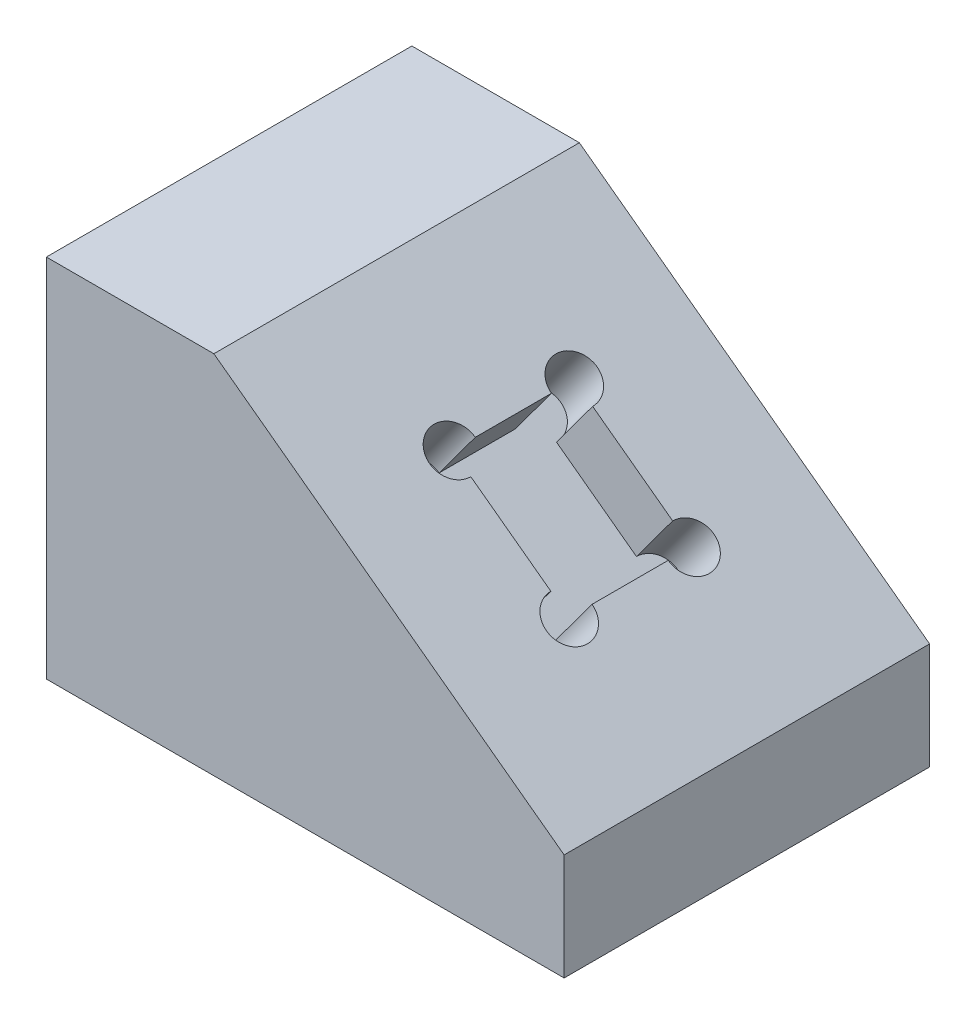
ISO-10303-21;
HEADER;
FILE_DESCRIPTION(('STEP AP214'),'2;1');
FILE_NAME('part.step','',(''),(''),'','','');
FILE_SCHEMA(('AUTOMOTIVE_DESIGN { 1 0 10303 214 1 1 1 1 }'));
ENDSEC;
DATA;
#1=APPLICATION_CONTEXT('core data for automotive mechanical design processes');
#2=APPLICATION_PROTOCOL_DEFINITION('international standard','automotive_design',2000,#1);
#3=PRODUCT_CONTEXT('',#1,'mechanical');
#4=PRODUCT('Part','Part','',(#3));
#5=PRODUCT_RELATED_PRODUCT_CATEGORY('part','',(#4));
#6=PRODUCT_DEFINITION_FORMATION('','',#4);
#7=PRODUCT_DEFINITION_CONTEXT('part definition',#1,'design');
#8=PRODUCT_DEFINITION('design','',#6,#7);
#9=PRODUCT_DEFINITION_SHAPE('','',#8);
#10=(LENGTH_UNIT() NAMED_UNIT(*) SI_UNIT(.MILLI.,.METRE.));
#11=(NAMED_UNIT(*) PLANE_ANGLE_UNIT() SI_UNIT($,.RADIAN.));
#12=(NAMED_UNIT(*) SI_UNIT($,.STERADIAN.) SOLID_ANGLE_UNIT());
#13=UNCERTAINTY_MEASURE_WITH_UNIT(LENGTH_MEASURE(1.E-05),#10,'distance_accuracy_value','');
#14=(GEOMETRIC_REPRESENTATION_CONTEXT(3) GLOBAL_UNCERTAINTY_ASSIGNED_CONTEXT((#13)) GLOBAL_UNIT_ASSIGNED_CONTEXT((#10,
#11,#12)) REPRESENTATION_CONTEXT('',''));
#15=CARTESIAN_POINT('',(0.,0.,0.));
#16=DIRECTION('',(0.,0.,1.));
#17=DIRECTION('',(1.,0.,0.));
#18=AXIS2_PLACEMENT_3D('',#15,#16,#17);
#19=CARTESIAN_POINT('',(0.,0.,-76.2));
#20=DIRECTION('',(-1.,0.,0.));
#21=DIRECTION('',(0.,0.,1.));
#22=AXIS2_PLACEMENT_3D('',#19,#20,#21);
#23=PLANE('',#22);
#24=DIRECTION('',(0.,-1.,0.));
#25=VECTOR('',#24,1.);
#26=CARTESIAN_POINT('',(0.,0.,0.));
#27=LINE('',#26,#25);
#28=CARTESIAN_POINT('',(0.,76.2,0.));
#29=VERTEX_POINT('',#28);
#30=CARTESIAN_POINT('',(0.,0.,0.));
#31=VERTEX_POINT('',#30);
#32=EDGE_CURVE('E122',#29,#31,#27,.T.);
#33=ORIENTED_EDGE('',*,*,#32,.F.);
#34=DIRECTION('',(0.,0.,1.));
#35=VECTOR('',#34,1.);
#36=CARTESIAN_POINT('',(0.,76.2,-76.2));
#37=LINE('',#36,#35);
#38=CARTESIAN_POINT('',(0.,76.2,-76.2));
#39=VERTEX_POINT('',#38);
#40=EDGE_CURVE('E11',#39,#29,#37,.T.);
#41=ORIENTED_EDGE('',*,*,#40,.F.);
#42=DIRECTION('',(0.,-1.,0.));
#43=VECTOR('',#42,1.);
#44=CARTESIAN_POINT('',(0.,0.,-76.2));
#45=LINE('',#44,#43);
#46=CARTESIAN_POINT('',(0.,0.,-76.2));
#47=VERTEX_POINT('',#46);
#48=EDGE_CURVE('E117',#39,#47,#45,.T.);
#49=ORIENTED_EDGE('',*,*,#48,.T.);
#50=DIRECTION('',(0.,0.,1.));
#51=VECTOR('',#50,1.);
#52=CARTESIAN_POINT('',(0.,0.,-76.2));
#53=LINE('',#52,#51);
#54=EDGE_CURVE('E35',#47,#31,#53,.T.);
#55=ORIENTED_EDGE('',*,*,#54,.T.);
#56=EDGE_LOOP('',(#33,#41,#49,#55));
#57=FACE_BOUND('',#56,.T.);
#58=ADVANCED_FACE('F32',(#57),#23,.T.);
#59=CARTESIAN_POINT('',(0.,76.2,-76.2));
#60=DIRECTION('',(0.,1.,0.));
#61=DIRECTION('',(0.,0.,1.));
#62=AXIS2_PLACEMENT_3D('',#59,#60,#61);
#63=PLANE('',#62);
#64=DIRECTION('',(-1.,0.,0.));
#65=VECTOR('',#64,1.);
#66=CARTESIAN_POINT('',(0.,76.2,0.));
#67=LINE('',#66,#65);
#68=CARTESIAN_POINT('',(34.925,76.2,0.));
#69=VERTEX_POINT('',#68);
#70=EDGE_CURVE('E132',#69,#29,#67,.T.);
#71=ORIENTED_EDGE('',*,*,#70,.F.);
#72=DIRECTION('',(0.,0.,1.));
#73=VECTOR('',#72,1.);
#74=CARTESIAN_POINT('',(34.925,76.2,-76.2));
#75=LINE('',#74,#73);
#76=CARTESIAN_POINT('',(34.925,76.2,-76.2));
#77=VERTEX_POINT('',#76);
#78=EDGE_CURVE('E40',#77,#69,#75,.T.);
#79=ORIENTED_EDGE('',*,*,#78,.F.);
#80=DIRECTION('',(-1.,0.,0.));
#81=VECTOR('',#80,1.);
#82=CARTESIAN_POINT('',(0.,76.2,-76.2));
#83=LINE('',#82,#81);
#84=EDGE_CURVE('E112',#77,#39,#83,.T.);
#85=ORIENTED_EDGE('',*,*,#84,.T.);
#86=ORIENTED_EDGE('',*,*,#40,.T.);
#87=EDGE_LOOP('',(#71,#79,#85,#86));
#88=FACE_BOUND('',#87,.T.);
#89=ADVANCED_FACE('F138',(#88),#63,.T.);
#90=CARTESIAN_POINT('',(34.925,76.2,-76.2));
#91=DIRECTION('',(0.594391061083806,0.804176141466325,0.));
#92=DIRECTION('',(-0.804176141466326,0.594391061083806,0.));
#93=AXIS2_PLACEMENT_3D('',#90,#91,#92);
#94=PLANE('',#93);
#95=CARTESIAN_POINT('',(59.2666666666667,58.2083333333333,-25.4));
#96=DIRECTION('',(0.594391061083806,0.804176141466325,0.));
#97=DIRECTION('',(-0.804176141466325,0.594391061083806,0.));
#98=AXIS2_PLACEMENT_3D('',#95,#96,#97);
#99=CIRCLE('',#98,4.7625);
#100=CARTESIAN_POINT('',(59.2666666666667,58.2083333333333,-30.1625));
#101=VERTEX_POINT('',#100);
#102=CARTESIAN_POINT('',(63.0965555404,55.3775459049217,-25.4));
#103=VERTEX_POINT('',#102);
#104=EDGE_CURVE('E48',#101,#103,#99,.T.);
#105=ORIENTED_EDGE('',*,*,#104,.F.);
#106=DIRECTION('',(0.,0.,1.));
#107=VECTOR('',#106,1.);
#108=CARTESIAN_POINT('',(59.2666666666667,58.2083333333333,-46.0375));
#109=LINE('',#108,#107);
#110=CARTESIAN_POINT('',(59.2666666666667,58.2083333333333,-46.0375));
#111=VERTEX_POINT('',#110);
#112=EDGE_CURVE('E209',#111,#101,#109,.T.);
#113=ORIENTED_EDGE('',*,*,#112,.F.);
#114=CARTESIAN_POINT('',(59.2666666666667,58.2083333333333,-50.8));
#115=DIRECTION('',(0.594391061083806,0.804176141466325,0.));
#116=DIRECTION('',(-0.804176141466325,0.594391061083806,0.));
#117=AXIS2_PLACEMENT_3D('',#114,#115,#116);
#118=CIRCLE('',#117,4.7625);
#119=CARTESIAN_POINT('',(63.0965555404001,55.3775459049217,-50.8));
#120=VERTEX_POINT('',#119);
#121=EDGE_CURVE('E214',#120,#111,#118,.T.);
#122=ORIENTED_EDGE('',*,*,#121,.F.);
#123=DIRECTION('',(-0.804176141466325,0.594391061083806,0.));
#124=VECTOR('',#123,1.);
#125=CARTESIAN_POINT('',(79.7784444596,43.0474540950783,-50.8));
#126=LINE('',#125,#124);
#127=CARTESIAN_POINT('',(79.7784444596,43.0474540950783,-50.8));
#128=VERTEX_POINT('',#127);
#129=EDGE_CURVE('E244',#128,#120,#126,.T.);
#130=ORIENTED_EDGE('',*,*,#129,.F.);
#131=CARTESIAN_POINT('',(83.6083333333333,40.2166666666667,-50.8));
#132=DIRECTION('',(0.594391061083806,0.804176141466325,0.));
#133=DIRECTION('',(-0.804176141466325,0.594391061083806,0.));
#134=AXIS2_PLACEMENT_3D('',#131,#132,#133);
#135=CIRCLE('',#134,4.7625);
#136=CARTESIAN_POINT('',(83.6083333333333,40.2166666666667,-46.0375));
#137=VERTEX_POINT('',#136);
#138=EDGE_CURVE('E241',#137,#128,#135,.T.);
#139=ORIENTED_EDGE('',*,*,#138,.F.);
#140=DIRECTION('',(0.,0.,-1.));
#141=VECTOR('',#140,1.);
#142=CARTESIAN_POINT('',(83.6083333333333,40.2166666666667,-46.0375));
#143=LINE('',#142,#141);
#144=CARTESIAN_POINT('',(83.6083333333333,40.2166666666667,-30.1625));
#145=VERTEX_POINT('',#144);
#146=EDGE_CURVE('E238',#145,#137,#143,.T.);
#147=ORIENTED_EDGE('',*,*,#146,.F.);
#148=CARTESIAN_POINT('',(83.6083333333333,40.2166666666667,-25.4));
#149=DIRECTION('',(0.594391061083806,0.804176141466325,0.));
#150=DIRECTION('',(-0.804176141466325,0.594391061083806,0.));
#151=AXIS2_PLACEMENT_3D('',#148,#149,#150);
#152=CIRCLE('',#151,4.7625);
#153=CARTESIAN_POINT('',(79.7784444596,43.0474540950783,-25.4));
#154=VERTEX_POINT('',#153);
#155=EDGE_CURVE('E235',#154,#145,#152,.T.);
#156=ORIENTED_EDGE('',*,*,#155,.F.);
#157=DIRECTION('',(0.804176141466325,-0.594391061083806,0.));
#158=VECTOR('',#157,1.);
#159=CARTESIAN_POINT('',(79.7784444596,43.0474540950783,-25.4));
#160=LINE('',#159,#158);
#161=EDGE_CURVE('E232',#103,#154,#160,.T.);
#162=ORIENTED_EDGE('',*,*,#161,.F.);
#163=EDGE_LOOP('',(#105,#113,#122,#130,#139,#147,#156,#162));
#164=FACE_BOUND('',#163,.T.);
#165=DIRECTION('',(-0.804176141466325,0.594391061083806,0.));
#166=VECTOR('',#165,1.);
#167=CARTESIAN_POINT('',(34.925,76.2,0.));
#168=LINE('',#167,#166);
#169=CARTESIAN_POINT('',(107.95,22.225,0.));
#170=VERTEX_POINT('',#169);
#171=EDGE_CURVE('E101',#170,#69,#168,.T.);
#172=ORIENTED_EDGE('',*,*,#171,.F.);
#173=DIRECTION('',(0.,0.,1.));
#174=VECTOR('',#173,1.);
#175=CARTESIAN_POINT('',(107.95,22.225,-76.2));
#176=LINE('',#175,#174);
#177=CARTESIAN_POINT('',(107.95,22.225,-76.2));
#178=VERTEX_POINT('',#177);
#179=EDGE_CURVE('E95',#178,#170,#176,.T.);
#180=ORIENTED_EDGE('',*,*,#179,.F.);
#181=DIRECTION('',(-0.804176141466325,0.594391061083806,0.));
#182=VECTOR('',#181,1.);
#183=CARTESIAN_POINT('',(34.925,76.2,-76.2));
#184=LINE('',#183,#182);
#185=EDGE_CURVE('E98',#178,#77,#184,.T.);
#186=ORIENTED_EDGE('',*,*,#185,.T.);
#187=ORIENTED_EDGE('',*,*,#78,.T.);
#188=EDGE_LOOP('',(#172,#180,#186,#187));
#189=FACE_BOUND('',#188,.T.);
#190=ADVANCED_FACE('F97',(#164,#189),#94,.T.);
#191=CARTESIAN_POINT('',(107.95,0.,-76.2));
#192=DIRECTION('',(1.,0.,0.));
#193=DIRECTION('',(0.,0.,-1.));
#194=AXIS2_PLACEMENT_3D('',#191,#192,#193);
#195=PLANE('',#194);
#196=DIRECTION('',(0.,1.,0.));
#197=VECTOR('',#196,1.);
#198=CARTESIAN_POINT('',(107.95,0.,0.));
#199=LINE('',#198,#197);
#200=CARTESIAN_POINT('',(107.95,0.,0.));
#201=VERTEX_POINT('',#200);
#202=EDGE_CURVE('E129',#201,#170,#199,.T.);
#203=ORIENTED_EDGE('',*,*,#202,.F.);
#204=DIRECTION('',(0.,0.,1.));
#205=VECTOR('',#204,1.);
#206=CARTESIAN_POINT('',(107.95,0.,-76.2));
#207=LINE('',#206,#205);
#208=CARTESIAN_POINT('',(107.95,0.,-76.2));
#209=VERTEX_POINT('',#208);
#210=EDGE_CURVE('E106',#209,#201,#207,.T.);
#211=ORIENTED_EDGE('',*,*,#210,.F.);
#212=DIRECTION('',(0.,1.,0.));
#213=VECTOR('',#212,1.);
#214=CARTESIAN_POINT('',(107.95,0.,-76.2));
#215=LINE('',#214,#213);
#216=EDGE_CURVE('E111',#209,#178,#215,.T.);
#217=ORIENTED_EDGE('',*,*,#216,.T.);
#218=ORIENTED_EDGE('',*,*,#179,.T.);
#219=EDGE_LOOP('',(#203,#211,#217,#218));
#220=FACE_BOUND('',#219,.T.);
#221=ADVANCED_FACE('F114',(#220),#195,.T.);
#222=CARTESIAN_POINT('',(0.,0.,-76.2));
#223=DIRECTION('',(0.,-1.,0.));
#224=DIRECTION('',(0.,0.,-1.));
#225=AXIS2_PLACEMENT_3D('',#222,#223,#224);
#226=PLANE('',#225);
#227=DIRECTION('',(1.,0.,0.));
#228=VECTOR('',#227,1.);
#229=CARTESIAN_POINT('',(0.,0.,0.));
#230=LINE('',#229,#228);
#231=EDGE_CURVE('E125',#31,#201,#230,.T.);
#232=ORIENTED_EDGE('',*,*,#231,.F.);
#233=ORIENTED_EDGE('',*,*,#54,.F.);
#234=DIRECTION('',(1.,0.,0.));
#235=VECTOR('',#234,1.);
#236=CARTESIAN_POINT('',(0.,0.,-76.2));
#237=LINE('',#236,#235);
#238=EDGE_CURVE('E115',#47,#209,#237,.T.);
#239=ORIENTED_EDGE('',*,*,#238,.T.);
#240=ORIENTED_EDGE('',*,*,#210,.T.);
#241=EDGE_LOOP('',(#232,#233,#239,#240));
#242=FACE_BOUND('',#241,.T.);
#243=ADVANCED_FACE('F135',(#242),#226,.T.);
#244=CARTESIAN_POINT('',(0.,76.2,-76.2));
#245=DIRECTION('',(0.,0.,-1.));
#246=DIRECTION('',(-1.,0.,0.));
#247=AXIS2_PLACEMENT_3D('',#244,#245,#246);
#248=PLANE('',#247);
#249=ORIENTED_EDGE('',*,*,#48,.F.);
#250=ORIENTED_EDGE('',*,*,#84,.F.);
#251=ORIENTED_EDGE('',*,*,#185,.F.);
#252=ORIENTED_EDGE('',*,*,#216,.F.);
#253=ORIENTED_EDGE('',*,*,#238,.F.);
#254=EDGE_LOOP('',(#249,#250,#251,#252,#253));
#255=FACE_BOUND('',#254,.T.);
#256=ADVANCED_FACE('F110',(#255),#248,.T.);
#257=CARTESIAN_POINT('',(0.,76.2,0.));
#258=DIRECTION('',(0.,0.,-1.));
#259=DIRECTION('',(-1.,0.,0.));
#260=AXIS2_PLACEMENT_3D('',#257,#258,#259);
#261=PLANE('',#260);
#262=ORIENTED_EDGE('',*,*,#32,.T.);
#263=ORIENTED_EDGE('',*,*,#231,.T.);
#264=ORIENTED_EDGE('',*,*,#202,.T.);
#265=ORIENTED_EDGE('',*,*,#171,.T.);
#266=ORIENTED_EDGE('',*,*,#70,.T.);
#267=EDGE_LOOP('',(#262,#263,#264,#265,#266));
#268=FACE_BOUND('',#267,.T.);
#269=ADVANCED_FACE('F137',(#268),#261,.F.);
#270=CARTESIAN_POINT('',(51.7179001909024,47.995296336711,-25.4));
#271=DIRECTION('',(0.594391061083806,0.804176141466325,0.));
#272=DIRECTION('',(-0.804176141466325,0.594391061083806,0.));
#273=AXIS2_PLACEMENT_3D('',#270,#271,#272);
#274=CYLINDRICAL_SURFACE('',#273,4.7625);
#275=ORIENTED_EDGE('',*,*,#104,.T.);
#276=DIRECTION('',(0.594391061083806,0.804176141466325,0.));
#277=VECTOR('',#276,1.);
#278=CARTESIAN_POINT('',(55.5477890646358,45.1645089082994,-25.4));
#279=LINE('',#278,#277);
#280=CARTESIAN_POINT('',(55.5477890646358,45.1645089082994,-25.4));
#281=VERTEX_POINT('',#280);
#282=EDGE_CURVE('E230',#281,#103,#279,.T.);
#283=ORIENTED_EDGE('',*,*,#282,.F.);
#284=CARTESIAN_POINT('',(51.7179001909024,47.995296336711,-25.4));
#285=DIRECTION('',(0.594391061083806,0.804176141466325,0.));
#286=DIRECTION('',(-0.804176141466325,0.594391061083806,0.));
#287=AXIS2_PLACEMENT_3D('',#284,#285,#286);
#288=CIRCLE('',#287,4.7625);
#289=CARTESIAN_POINT('',(51.7179001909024,47.995296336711,-30.1625));
#290=VERTEX_POINT('',#289);
#291=EDGE_CURVE('E200',#290,#281,#288,.T.);
#292=ORIENTED_EDGE('',*,*,#291,.F.);
#293=DIRECTION('',(0.594391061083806,0.804176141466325,0.));
#294=VECTOR('',#293,1.);
#295=CARTESIAN_POINT('',(51.7179001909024,47.995296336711,-30.1625));
#296=LINE('',#295,#294);
#297=EDGE_CURVE('E126',#290,#101,#296,.T.);
#298=ORIENTED_EDGE('',*,*,#297,.T.);
#299=EDGE_LOOP('',(#275,#283,#292,#298));
#300=FACE_BOUND('',#299,.T.);
#301=ADVANCED_FACE('F158',(#300),#274,.F.);
#302=CARTESIAN_POINT('',(51.7179001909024,47.995296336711,-46.0375));
#303=DIRECTION('',(-0.804176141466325,0.594391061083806,0.));
#304=DIRECTION('',(-0.594391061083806,-0.804176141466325,0.));
#305=AXIS2_PLACEMENT_3D('',#302,#303,#304);
#306=PLANE('',#305);
#307=ORIENTED_EDGE('',*,*,#112,.T.);
#308=ORIENTED_EDGE('',*,*,#297,.F.);
#309=DIRECTION('',(0.,0.,1.));
#310=VECTOR('',#309,1.);
#311=CARTESIAN_POINT('',(51.7179001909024,47.995296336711,-46.0375));
#312=LINE('',#311,#310);
#313=CARTESIAN_POINT('',(51.7179001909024,47.995296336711,-46.0375));
#314=VERTEX_POINT('',#313);
#315=EDGE_CURVE('E207',#314,#290,#312,.T.);
#316=ORIENTED_EDGE('',*,*,#315,.F.);
#317=DIRECTION('',(0.594391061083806,0.804176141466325,0.));
#318=VECTOR('',#317,1.);
#319=CARTESIAN_POINT('',(51.7179001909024,47.995296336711,-46.0375));
#320=LINE('',#319,#318);
#321=EDGE_CURVE('E250',#314,#111,#320,.T.);
#322=ORIENTED_EDGE('',*,*,#321,.T.);
#323=EDGE_LOOP('',(#307,#308,#316,#322));
#324=FACE_BOUND('',#323,.T.);
#325=ADVANCED_FACE('F162',(#324),#306,.F.);
#326=CARTESIAN_POINT('',(51.7179001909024,47.995296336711,-50.8));
#327=DIRECTION('',(0.594391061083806,0.804176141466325,0.));
#328=DIRECTION('',(-0.804176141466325,0.594391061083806,0.));
#329=AXIS2_PLACEMENT_3D('',#326,#327,#328);
#330=CYLINDRICAL_SURFACE('',#329,4.7625);
#331=ORIENTED_EDGE('',*,*,#121,.T.);
#332=ORIENTED_EDGE('',*,*,#321,.F.);
#333=CARTESIAN_POINT('',(51.7179001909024,47.995296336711,-50.8));
#334=DIRECTION('',(0.594391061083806,0.804176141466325,0.));
#335=DIRECTION('',(-0.804176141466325,0.594391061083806,0.));
#336=AXIS2_PLACEMENT_3D('',#333,#334,#335);
#337=CIRCLE('',#336,4.7625);
#338=CARTESIAN_POINT('',(55.5477890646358,45.1645089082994,-50.8));
#339=VERTEX_POINT('',#338);
#340=EDGE_CURVE('E227',#339,#314,#337,.T.);
#341=ORIENTED_EDGE('',*,*,#340,.F.);
#342=DIRECTION('',(0.594391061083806,0.804176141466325,0.));
#343=VECTOR('',#342,1.);
#344=CARTESIAN_POINT('',(55.5477890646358,45.1645089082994,-50.8));
#345=LINE('',#344,#343);
#346=EDGE_CURVE('E253',#339,#120,#345,.T.);
#347=ORIENTED_EDGE('',*,*,#346,.T.);
#348=EDGE_LOOP('',(#331,#332,#341,#347));
#349=FACE_BOUND('',#348,.T.);
#350=ADVANCED_FACE('F183',(#349),#330,.F.);
#351=CARTESIAN_POINT('',(72.2296779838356,32.834417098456,-50.8));
#352=DIRECTION('',(0.,0.,-1.));
#353=DIRECTION('',(-1.,0.,0.));
#354=AXIS2_PLACEMENT_3D('',#351,#352,#353);
#355=PLANE('',#354);
#356=ORIENTED_EDGE('',*,*,#129,.T.);
#357=ORIENTED_EDGE('',*,*,#346,.F.);
#358=DIRECTION('',(-0.804176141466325,0.594391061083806,0.));
#359=VECTOR('',#358,1.);
#360=CARTESIAN_POINT('',(72.2296779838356,32.834417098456,-50.8));
#361=LINE('',#360,#359);
#362=CARTESIAN_POINT('',(72.2296779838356,32.834417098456,-50.8));
#363=VERTEX_POINT('',#362);
#364=EDGE_CURVE('E224',#363,#339,#361,.T.);
#365=ORIENTED_EDGE('',*,*,#364,.F.);
#366=DIRECTION('',(0.594391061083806,0.804176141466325,0.));
#367=VECTOR('',#366,1.);
#368=CARTESIAN_POINT('',(72.2296779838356,32.834417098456,-50.8));
#369=LINE('',#368,#367);
#370=EDGE_CURVE('E256',#363,#128,#369,.T.);
#371=ORIENTED_EDGE('',*,*,#370,.T.);
#372=EDGE_LOOP('',(#356,#357,#365,#371));
#373=FACE_BOUND('',#372,.T.);
#374=ADVANCED_FACE('F179',(#373),#355,.F.);
#375=CARTESIAN_POINT('',(76.059566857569,30.0036296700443,-50.8));
#376=DIRECTION('',(0.594391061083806,0.804176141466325,0.));
#377=DIRECTION('',(-0.804176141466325,0.594391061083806,0.));
#378=AXIS2_PLACEMENT_3D('',#375,#376,#377);
#379=CYLINDRICAL_SURFACE('',#378,4.7625);
#380=ORIENTED_EDGE('',*,*,#138,.T.);
#381=ORIENTED_EDGE('',*,*,#370,.F.);
#382=CARTESIAN_POINT('',(76.059566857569,30.0036296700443,-50.8));
#383=DIRECTION('',(0.594391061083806,0.804176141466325,0.));
#384=DIRECTION('',(-0.804176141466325,0.594391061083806,0.));
#385=AXIS2_PLACEMENT_3D('',#382,#383,#384);
#386=CIRCLE('',#385,4.7625);
#387=CARTESIAN_POINT('',(76.059566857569,30.0036296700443,-46.0375));
#388=VERTEX_POINT('',#387);
#389=EDGE_CURVE('E221',#388,#363,#386,.T.);
#390=ORIENTED_EDGE('',*,*,#389,.F.);
#391=DIRECTION('',(0.594391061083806,0.804176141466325,0.));
#392=VECTOR('',#391,1.);
#393=CARTESIAN_POINT('',(76.059566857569,30.0036296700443,-46.0375));
#394=LINE('',#393,#392);
#395=EDGE_CURVE('E259',#388,#137,#394,.T.);
#396=ORIENTED_EDGE('',*,*,#395,.T.);
#397=EDGE_LOOP('',(#380,#381,#390,#396));
#398=FACE_BOUND('',#397,.T.);
#399=ADVANCED_FACE('F175',(#398),#379,.F.);
#400=CARTESIAN_POINT('',(76.059566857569,30.0036296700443,-46.0375));
#401=DIRECTION('',(0.804176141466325,-0.594391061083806,0.));
#402=DIRECTION('',(0.594391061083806,0.804176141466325,0.));
#403=AXIS2_PLACEMENT_3D('',#400,#401,#402);
#404=PLANE('',#403);
#405=ORIENTED_EDGE('',*,*,#146,.T.);
#406=ORIENTED_EDGE('',*,*,#395,.F.);
#407=DIRECTION('',(0.,0.,-1.));
#408=VECTOR('',#407,1.);
#409=CARTESIAN_POINT('',(76.059566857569,30.0036296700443,-46.0375));
#410=LINE('',#409,#408);
#411=CARTESIAN_POINT('',(76.059566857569,30.0036296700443,-30.1625));
#412=VERTEX_POINT('',#411);
#413=EDGE_CURVE('E218',#412,#388,#410,.T.);
#414=ORIENTED_EDGE('',*,*,#413,.F.);
#415=DIRECTION('',(0.594391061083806,0.804176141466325,0.));
#416=VECTOR('',#415,1.);
#417=CARTESIAN_POINT('',(76.059566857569,30.0036296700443,-30.1625));
#418=LINE('',#417,#416);
#419=EDGE_CURVE('E262',#412,#145,#418,.T.);
#420=ORIENTED_EDGE('',*,*,#419,.T.);
#421=EDGE_LOOP('',(#405,#406,#414,#420));
#422=FACE_BOUND('',#421,.T.);
#423=ADVANCED_FACE('F171',(#422),#404,.F.);
#424=CARTESIAN_POINT('',(76.059566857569,30.0036296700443,-25.4));
#425=DIRECTION('',(0.594391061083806,0.804176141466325,0.));
#426=DIRECTION('',(-0.804176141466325,0.594391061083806,0.));
#427=AXIS2_PLACEMENT_3D('',#424,#425,#426);
#428=CYLINDRICAL_SURFACE('',#427,4.7625);
#429=ORIENTED_EDGE('',*,*,#155,.T.);
#430=ORIENTED_EDGE('',*,*,#419,.F.);
#431=CARTESIAN_POINT('',(76.059566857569,30.0036296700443,-25.4));
#432=DIRECTION('',(0.594391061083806,0.804176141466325,0.));
#433=DIRECTION('',(-0.804176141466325,0.594391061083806,0.));
#434=AXIS2_PLACEMENT_3D('',#431,#432,#433);
#435=CIRCLE('',#434,4.7625);
#436=CARTESIAN_POINT('',(72.2296779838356,32.834417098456,-25.4));
#437=VERTEX_POINT('',#436);
#438=EDGE_CURVE('E211',#437,#412,#435,.T.);
#439=ORIENTED_EDGE('',*,*,#438,.F.);
#440=DIRECTION('',(0.594391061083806,0.804176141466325,0.));
#441=VECTOR('',#440,1.);
#442=CARTESIAN_POINT('',(72.2296779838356,32.834417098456,-25.4));
#443=LINE('',#442,#441);
#444=EDGE_CURVE('E265',#437,#154,#443,.T.);
#445=ORIENTED_EDGE('',*,*,#444,.T.);
#446=EDGE_LOOP('',(#429,#430,#439,#445));
#447=FACE_BOUND('',#446,.T.);
#448=ADVANCED_FACE('F167',(#447),#428,.F.);
#449=CARTESIAN_POINT('',(72.2296779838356,32.834417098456,-25.4));
#450=DIRECTION('',(0.,0.,1.));
#451=DIRECTION('',(1.,0.,0.));
#452=AXIS2_PLACEMENT_3D('',#449,#450,#451);
#453=PLANE('',#452);
#454=ORIENTED_EDGE('',*,*,#161,.T.);
#455=ORIENTED_EDGE('',*,*,#444,.F.);
#456=DIRECTION('',(0.804176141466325,-0.594391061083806,0.));
#457=VECTOR('',#456,1.);
#458=CARTESIAN_POINT('',(72.2296779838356,32.834417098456,-25.4));
#459=LINE('',#458,#457);
#460=EDGE_CURVE('E204',#281,#437,#459,.T.);
#461=ORIENTED_EDGE('',*,*,#460,.F.);
#462=ORIENTED_EDGE('',*,*,#282,.T.);
#463=EDGE_LOOP('',(#454,#455,#461,#462));
#464=FACE_BOUND('',#463,.T.);
#465=ADVANCED_FACE('F163',(#464),#453,.F.);
#466=CARTESIAN_POINT('',(51.7179001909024,47.995296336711,-25.4));
#467=DIRECTION('',(0.594391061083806,0.804176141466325,0.));
#468=DIRECTION('',(-0.804176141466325,0.594391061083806,0.));
#469=AXIS2_PLACEMENT_3D('',#466,#467,#468);
#470=PLANE('',#469);
#471=ORIENTED_EDGE('',*,*,#291,.T.);
#472=ORIENTED_EDGE('',*,*,#460,.T.);
#473=ORIENTED_EDGE('',*,*,#438,.T.);
#474=ORIENTED_EDGE('',*,*,#413,.T.);
#475=ORIENTED_EDGE('',*,*,#389,.T.);
#476=ORIENTED_EDGE('',*,*,#364,.T.);
#477=ORIENTED_EDGE('',*,*,#340,.T.);
#478=ORIENTED_EDGE('',*,*,#315,.T.);
#479=EDGE_LOOP('',(#471,#472,#473,#474,#475,#476,#477,#478));
#480=FACE_BOUND('',#479,.T.);
#481=ADVANCED_FACE('F166',(#480),#470,.T.);
#482=CLOSED_SHELL('',(#58,#89,#190,#221,#243,#256,#269,#301,#325,#350,#374,#399,#423,#448,#465,#481));
#483=MANIFOLD_SOLID_BREP('B2',#482);
#484=ADVANCED_BREP_SHAPE_REPRESENTATION('',(#18,#483),#14);
#485=SHAPE_DEFINITION_REPRESENTATION(#9,#484);
ENDSEC;
END-ISO-10303-21;
